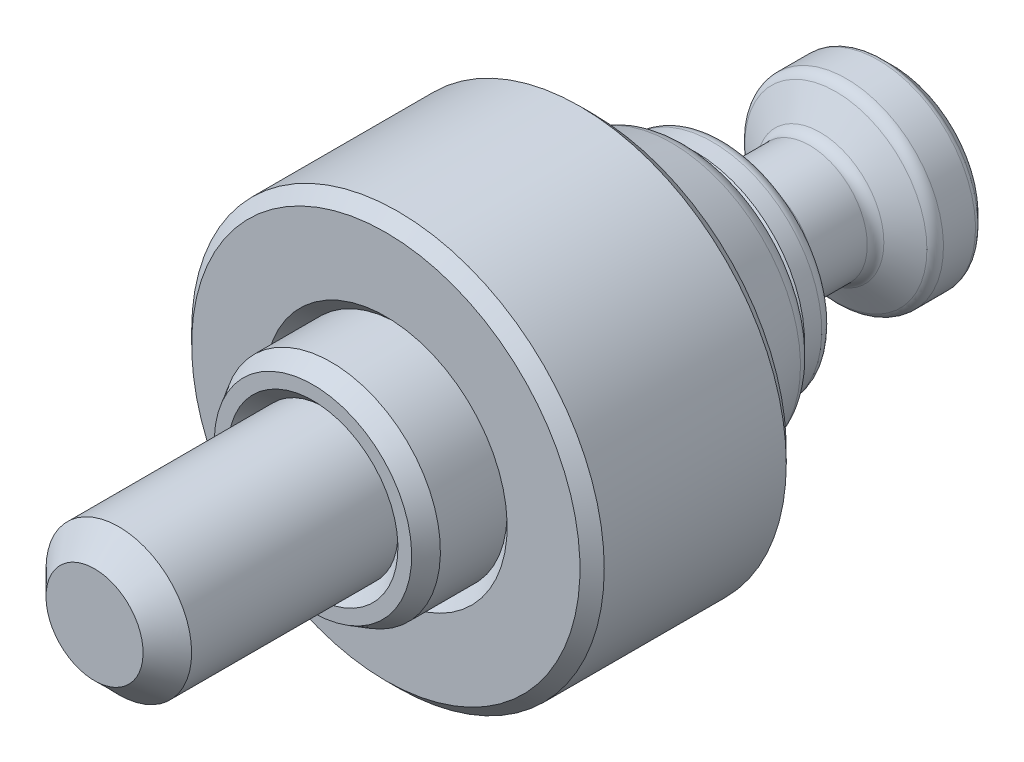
ISO-10303-21;
HEADER;
FILE_DESCRIPTION(('STEP AP214'),'2;1');
FILE_NAME('part.step','',(''),(''),'','','');
FILE_SCHEMA(('AUTOMOTIVE_DESIGN { 1 0 10303 214 1 1 1 1 }'));
ENDSEC;
DATA;
#1=APPLICATION_CONTEXT('core data for automotive mechanical design processes');
#2=APPLICATION_PROTOCOL_DEFINITION('international standard','automotive_design',2000,#1);
#3=PRODUCT_CONTEXT('',#1,'mechanical');
#4=PRODUCT('Part','Part','',(#3));
#5=PRODUCT_RELATED_PRODUCT_CATEGORY('part','',(#4));
#6=PRODUCT_DEFINITION_FORMATION('','',#4);
#7=PRODUCT_DEFINITION_CONTEXT('part definition',#1,'design');
#8=PRODUCT_DEFINITION('design','',#6,#7);
#9=PRODUCT_DEFINITION_SHAPE('','',#8);
#10=(LENGTH_UNIT() NAMED_UNIT(*) SI_UNIT(.MILLI.,.METRE.));
#11=(NAMED_UNIT(*) PLANE_ANGLE_UNIT() SI_UNIT($,.RADIAN.));
#12=(NAMED_UNIT(*) SI_UNIT($,.STERADIAN.) SOLID_ANGLE_UNIT());
#13=UNCERTAINTY_MEASURE_WITH_UNIT(LENGTH_MEASURE(1.E-05),#10,'distance_accuracy_value','');
#14=(GEOMETRIC_REPRESENTATION_CONTEXT(3) GLOBAL_UNCERTAINTY_ASSIGNED_CONTEXT((#13)) GLOBAL_UNIT_ASSIGNED_CONTEXT((#10,
#11,#12)) REPRESENTATION_CONTEXT('',''));
#15=CARTESIAN_POINT('',(0.,0.,0.));
#16=DIRECTION('',(0.,0.,1.));
#17=DIRECTION('',(1.,0.,0.));
#18=AXIS2_PLACEMENT_3D('',#15,#16,#17);
#19=CARTESIAN_POINT('',(0.,0.,0.));
#20=DIRECTION('',(0.,0.,-1.));
#21=DIRECTION('',(0.,1.,0.));
#22=AXIS2_PLACEMENT_3D('',#19,#20,#21);
#23=CYLINDRICAL_SURFACE('',#22,17.);
#24=CARTESIAN_POINT('',(0.,0.,16.));
#25=DIRECTION('',(0.,0.,1.));
#26=DIRECTION('',(0.,-1.,0.));
#27=AXIS2_PLACEMENT_3D('',#24,#25,#26);
#28=CIRCLE('',#27,17.);
#29=CARTESIAN_POINT('',(0.,-17.,16.));
#30=VERTEX_POINT('',#29);
#31=EDGE_CURVE('E331',#30,#30,#28,.F.);
#32=ORIENTED_EDGE('',*,*,#31,.T.);
#33=EDGE_LOOP('',(#32));
#34=FACE_BOUND('',#33,.T.);
#35=CARTESIAN_POINT('',(0.,0.,1.));
#36=DIRECTION('',(0.,0.,-1.));
#37=DIRECTION('',(0.,1.,0.));
#38=AXIS2_PLACEMENT_3D('',#35,#36,#37);
#39=CIRCLE('',#38,17.);
#40=CARTESIAN_POINT('',(0.,17.,1.));
#41=VERTEX_POINT('',#40);
#42=EDGE_CURVE('E180',#41,#41,#39,.F.);
#43=ORIENTED_EDGE('',*,*,#42,.T.);
#44=EDGE_LOOP('',(#43));
#45=FACE_BOUND('',#44,.T.);
#46=ADVANCED_FACE('F14',(#34,#45),#23,.T.);
#47=CARTESIAN_POINT('',(0.,0.,0.));
#48=DIRECTION('',(0.,0.,1.));
#49=DIRECTION('',(0.,-1.,0.));
#50=AXIS2_PLACEMENT_3D('',#47,#48,#49);
#51=CONICAL_SURFACE('',#50,16.,0.78539816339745);
#52=ORIENTED_EDGE('',*,*,#42,.F.);
#53=EDGE_LOOP('',(#52));
#54=FACE_BOUND('',#53,.T.);
#55=CARTESIAN_POINT('',(0.,0.,0.));
#56=DIRECTION('',(0.,0.,-1.));
#57=DIRECTION('',(0.,1.,0.));
#58=AXIS2_PLACEMENT_3D('',#55,#56,#57);
#59=CIRCLE('',#58,16.);
#60=CARTESIAN_POINT('',(0.,16.,0.));
#61=VERTEX_POINT('',#60);
#62=EDGE_CURVE('E340',#61,#61,#59,.T.);
#63=ORIENTED_EDGE('',*,*,#62,.F.);
#64=EDGE_LOOP('',(#63));
#65=FACE_BOUND('',#64,.T.);
#66=ADVANCED_FACE('F308',(#54,#65),#51,.T.);
#67=CARTESIAN_POINT('',(17.,0.,0.));
#68=DIRECTION('',(0.,0.,-1.));
#69=DIRECTION('',(0.,1.,0.));
#70=AXIS2_PLACEMENT_3D('',#67,#68,#69);
#71=PLANE('',#70);
#72=ORIENTED_EDGE('',*,*,#62,.T.);
#73=EDGE_LOOP('',(#72));
#74=FACE_BOUND('',#73,.T.);
#75=CARTESIAN_POINT('',(0.,0.,0.));
#76=DIRECTION('',(0.,0.,-1.));
#77=DIRECTION('',(-1.,0.,0.));
#78=AXIS2_PLACEMENT_3D('',#75,#76,#77);
#79=CIRCLE('',#78,12.05);
#80=CARTESIAN_POINT('',(-12.05,0.,0.));
#81=VERTEX_POINT('',#80);
#82=EDGE_CURVE('E9',#81,#81,#79,.T.);
#83=ORIENTED_EDGE('',*,*,#82,.F.);
#84=EDGE_LOOP('',(#83));
#85=FACE_BOUND('',#84,.T.);
#86=ADVANCED_FACE('F311',(#74,#85),#71,.T.);
#87=CARTESIAN_POINT('',(0.,0.,16.));
#88=DIRECTION('',(0.,0.,-1.));
#89=DIRECTION('',(0.,1.,0.));
#90=AXIS2_PLACEMENT_3D('',#87,#88,#89);
#91=CONICAL_SURFACE('',#90,17.,0.785398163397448);
#92=CARTESIAN_POINT('',(0.,0.,17.));
#93=DIRECTION('',(0.,0.,1.));
#94=DIRECTION('',(0.,-1.,0.));
#95=AXIS2_PLACEMENT_3D('',#92,#93,#94);
#96=CIRCLE('',#95,16.);
#97=CARTESIAN_POINT('',(0.,-16.,17.));
#98=VERTEX_POINT('',#97);
#99=EDGE_CURVE('E335',#98,#98,#96,.T.);
#100=ORIENTED_EDGE('',*,*,#99,.F.);
#101=EDGE_LOOP('',(#100));
#102=FACE_BOUND('',#101,.T.);
#103=ORIENTED_EDGE('',*,*,#31,.F.);
#104=EDGE_LOOP('',(#103));
#105=FACE_BOUND('',#104,.T.);
#106=ADVANCED_FACE('F313',(#102,#105),#91,.T.);
#107=CARTESIAN_POINT('',(9.,0.,17.));
#108=DIRECTION('',(0.,0.,1.));
#109=DIRECTION('',(0.,-1.,0.));
#110=AXIS2_PLACEMENT_3D('',#107,#108,#109);
#111=PLANE('',#110);
#112=CARTESIAN_POINT('',(0.,0.,17.));
#113=DIRECTION('',(0.,0.,1.));
#114=DIRECTION('',(0.,-1.,0.));
#115=AXIS2_PLACEMENT_3D('',#112,#113,#114);
#116=CIRCLE('',#115,10.);
#117=CARTESIAN_POINT('',(0.,-10.,17.));
#118=VERTEX_POINT('',#117);
#119=EDGE_CURVE('E23',#118,#118,#116,.F.);
#120=ORIENTED_EDGE('',*,*,#119,.T.);
#121=EDGE_LOOP('',(#120));
#122=FACE_BOUND('',#121,.T.);
#123=ORIENTED_EDGE('',*,*,#99,.T.);
#124=EDGE_LOOP('',(#123));
#125=FACE_BOUND('',#124,.T.);
#126=ADVANCED_FACE('F306',(#122,#125),#111,.T.);
#127=CARTESIAN_POINT('',(0.,0.,17.));
#128=DIRECTION('',(0.,0.,1.));
#129=DIRECTION('',(0.,-1.,0.));
#130=AXIS2_PLACEMENT_3D('',#127,#128,#129);
#131=CONICAL_SURFACE('',#130,10.,0.785398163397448);
#132=CARTESIAN_POINT('',(0.,0.,16.));
#133=DIRECTION('',(0.,0.,1.));
#134=DIRECTION('',(0.,-1.,0.));
#135=AXIS2_PLACEMENT_3D('',#132,#133,#134);
#136=CIRCLE('',#135,9.);
#137=CARTESIAN_POINT('',(0.,-9.,16.));
#138=VERTEX_POINT('',#137);
#139=EDGE_CURVE('E343',#138,#138,#136,.T.);
#140=ORIENTED_EDGE('',*,*,#139,.F.);
#141=EDGE_LOOP('',(#140));
#142=FACE_BOUND('',#141,.T.);
#143=ORIENTED_EDGE('',*,*,#119,.F.);
#144=EDGE_LOOP('',(#143));
#145=FACE_BOUND('',#144,.T.);
#146=ADVANCED_FACE('F303',(#142,#145),#131,.F.);
#147=CARTESIAN_POINT('',(0.,0.,41.));
#148=DIRECTION('',(0.,0.,1.));
#149=DIRECTION('',(0.,1.,0.));
#150=AXIS2_PLACEMENT_3D('',#147,#148,#149);
#151=PLANE('',#150);
#152=CARTESIAN_POINT('',(0.,0.,41.));
#153=DIRECTION('',(0.,0.,1.));
#154=DIRECTION('',(0.,1.,0.));
#155=AXIS2_PLACEMENT_3D('',#152,#153,#154);
#156=CIRCLE('',#155,4.);
#157=CARTESIAN_POINT('',(0.,4.,41.));
#158=VERTEX_POINT('',#157);
#159=EDGE_CURVE('E128',#158,#158,#156,.T.);
#160=ORIENTED_EDGE('',*,*,#159,.T.);
#161=EDGE_LOOP('',(#160));
#162=FACE_BOUND('',#161,.T.);
#163=ADVANCED_FACE('F291',(#162),#151,.T.);
#164=CARTESIAN_POINT('',(0.,0.,39.));
#165=DIRECTION('',(0.,0.,-1.));
#166=DIRECTION('',(0.,-1.,0.));
#167=AXIS2_PLACEMENT_3D('',#164,#165,#166);
#168=CONICAL_SURFACE('',#167,6.,0.78539816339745);
#169=ORIENTED_EDGE('',*,*,#159,.F.);
#170=EDGE_LOOP('',(#169));
#171=FACE_BOUND('',#170,.T.);
#172=CARTESIAN_POINT('',(0.,0.,39.));
#173=DIRECTION('',(0.,0.,1.));
#174=DIRECTION('',(0.,1.,0.));
#175=AXIS2_PLACEMENT_3D('',#172,#173,#174);
#176=CIRCLE('',#175,6.);
#177=CARTESIAN_POINT('',(0.,6.,39.));
#178=VERTEX_POINT('',#177);
#179=EDGE_CURVE('E125',#178,#178,#176,.F.);
#180=ORIENTED_EDGE('',*,*,#179,.F.);
#181=EDGE_LOOP('',(#180));
#182=FACE_BOUND('',#181,.T.);
#183=ADVANCED_FACE('F272',(#171,#182),#168,.T.);
#184=CARTESIAN_POINT('',(0.,0.,-8.));
#185=DIRECTION('',(0.,0.,-1.));
#186=DIRECTION('',(0.,-1.,0.));
#187=AXIS2_PLACEMENT_3D('',#184,#185,#186);
#188=CYLINDRICAL_SURFACE('',#187,6.);
#189=CARTESIAN_POINT('',(0.,0.,22.));
#190=DIRECTION('',(0.,0.,1.));
#191=DIRECTION('',(0.,-1.,0.));
#192=AXIS2_PLACEMENT_3D('',#189,#190,#191);
#193=CIRCLE('',#192,6.);
#194=CARTESIAN_POINT('',(0.,-6.,22.));
#195=VERTEX_POINT('',#194);
#196=EDGE_CURVE('E171',#195,#195,#193,.T.);
#197=ORIENTED_EDGE('',*,*,#196,.T.);
#198=EDGE_LOOP('',(#197));
#199=FACE_BOUND('',#198,.T.);
#200=ORIENTED_EDGE('',*,*,#179,.T.);
#201=EDGE_LOOP('',(#200));
#202=FACE_BOUND('',#201,.T.);
#203=ADVANCED_FACE('F262',(#199,#202),#188,.T.);
#204=CARTESIAN_POINT('',(0.,0.,23.));
#205=DIRECTION('',(0.,0.,1.));
#206=DIRECTION('',(0.,-1.,0.));
#207=AXIS2_PLACEMENT_3D('',#204,#205,#206);
#208=CONICAL_SURFACE('',#207,7.,0.785398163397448);
#209=ORIENTED_EDGE('',*,*,#196,.F.);
#210=EDGE_LOOP('',(#209));
#211=FACE_BOUND('',#210,.T.);
#212=CARTESIAN_POINT('',(0.,0.,23.));
#213=DIRECTION('',(0.,0.,1.));
#214=DIRECTION('',(0.,-1.,0.));
#215=AXIS2_PLACEMENT_3D('',#212,#213,#214);
#216=CIRCLE('',#215,7.);
#217=CARTESIAN_POINT('',(0.,-7.,23.));
#218=VERTEX_POINT('',#217);
#219=EDGE_CURVE('E168',#218,#218,#216,.F.);
#220=ORIENTED_EDGE('',*,*,#219,.F.);
#221=EDGE_LOOP('',(#220));
#222=FACE_BOUND('',#221,.T.);
#223=ADVANCED_FACE('F259',(#211,#222),#208,.F.);
#224=CARTESIAN_POINT('',(6.,0.,23.));
#225=DIRECTION('',(0.,0.,1.));
#226=DIRECTION('',(0.,-1.,0.));
#227=AXIS2_PLACEMENT_3D('',#224,#225,#226);
#228=PLANE('',#227);
#229=ORIENTED_EDGE('',*,*,#219,.T.);
#230=EDGE_LOOP('',(#229));
#231=FACE_BOUND('',#230,.T.);
#232=CARTESIAN_POINT('',(0.,0.,23.));
#233=DIRECTION('',(0.,0.,1.));
#234=DIRECTION('',(0.,-1.,0.));
#235=AXIS2_PLACEMENT_3D('',#232,#233,#234);
#236=CIRCLE('',#235,8.13397459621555);
#237=CARTESIAN_POINT('',(0.,-8.13397459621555,23.));
#238=VERTEX_POINT('',#237);
#239=EDGE_CURVE('E165',#238,#238,#236,.T.);
#240=ORIENTED_EDGE('',*,*,#239,.T.);
#241=EDGE_LOOP('',(#240));
#242=FACE_BOUND('',#241,.T.);
#243=ADVANCED_FACE('F261',(#231,#242),#228,.T.);
#244=CARTESIAN_POINT('',(0.,0.,21.5));
#245=DIRECTION('',(0.,0.,-1.));
#246=DIRECTION('',(0.,1.,0.));
#247=AXIS2_PLACEMENT_3D('',#244,#245,#246);
#248=CONICAL_SURFACE('',#247,9.,0.523598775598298);
#249=ORIENTED_EDGE('',*,*,#239,.F.);
#250=EDGE_LOOP('',(#249));
#251=FACE_BOUND('',#250,.T.);
#252=CARTESIAN_POINT('',(0.,0.,21.5));
#253=DIRECTION('',(0.,0.,1.));
#254=DIRECTION('',(0.,-1.,0.));
#255=AXIS2_PLACEMENT_3D('',#252,#253,#254);
#256=CIRCLE('',#255,9.);
#257=CARTESIAN_POINT('',(0.,-9.,21.5));
#258=VERTEX_POINT('',#257);
#259=EDGE_CURVE('E162',#258,#258,#256,.F.);
#260=ORIENTED_EDGE('',*,*,#259,.F.);
#261=EDGE_LOOP('',(#260));
#262=FACE_BOUND('',#261,.T.);
#263=ADVANCED_FACE('F269',(#251,#262),#248,.T.);
#264=CARTESIAN_POINT('',(0.,0.,0.));
#265=DIRECTION('',(0.,0.,-1.));
#266=DIRECTION('',(0.,1.,0.));
#267=AXIS2_PLACEMENT_3D('',#264,#265,#266);
#268=CYLINDRICAL_SURFACE('',#267,9.);
#269=ORIENTED_EDGE('',*,*,#259,.T.);
#270=EDGE_LOOP('',(#269));
#271=FACE_BOUND('',#270,.T.);
#272=ORIENTED_EDGE('',*,*,#139,.T.);
#273=EDGE_LOOP('',(#272));
#274=FACE_BOUND('',#273,.T.);
#275=ADVANCED_FACE('F280',(#271,#274),#268,.T.);
#276=CARTESIAN_POINT('',(-2.88675134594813,0.,-21.5));
#277=DIRECTION('',(0.,0.,-1.));
#278=DIRECTION('',(0.,-1.,0.));
#279=AXIS2_PLACEMENT_3D('',#276,#277,#278);
#280=PLANE('',#279);
#281=DIRECTION('',(0.5,-0.86602540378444,0.));
#282=VECTOR('',#281,1.);
#283=CARTESIAN_POINT('',(1.44337567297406,2.5,-21.5));
#284=LINE('',#283,#282);
#285=CARTESIAN_POINT('',(1.44337567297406,2.5,-21.5));
#286=VERTEX_POINT('',#285);
#287=CARTESIAN_POINT('',(2.88675134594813,0.,-21.5));
#288=VERTEX_POINT('',#287);
#289=EDGE_CURVE('E639',#286,#288,#284,.T.);
#290=ORIENTED_EDGE('',*,*,#289,.T.);
#291=DIRECTION('',(-0.5,-0.86602540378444,0.));
#292=VECTOR('',#291,1.);
#293=CARTESIAN_POINT('',(2.88675134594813,0.,-21.5));
#294=LINE('',#293,#292);
#295=CARTESIAN_POINT('',(1.44337567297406,-2.5,-21.5));
#296=VERTEX_POINT('',#295);
#297=EDGE_CURVE('E642',#288,#296,#294,.T.);
#298=ORIENTED_EDGE('',*,*,#297,.T.);
#299=DIRECTION('',(-1.,0.,0.));
#300=VECTOR('',#299,1.);
#301=CARTESIAN_POINT('',(1.44337567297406,-2.5,-21.5));
#302=LINE('',#301,#300);
#303=CARTESIAN_POINT('',(-1.44337567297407,-2.5,-21.5));
#304=VERTEX_POINT('',#303);
#305=EDGE_CURVE('E39',#296,#304,#302,.T.);
#306=ORIENTED_EDGE('',*,*,#305,.T.);
#307=DIRECTION('',(-0.5,0.86602540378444,0.));
#308=VECTOR('',#307,1.);
#309=CARTESIAN_POINT('',(-1.44337567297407,-2.5,-21.5));
#310=LINE('',#309,#308);
#311=CARTESIAN_POINT('',(-2.88675134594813,0.,-21.5));
#312=VERTEX_POINT('',#311);
#313=EDGE_CURVE('E87',#304,#312,#310,.T.);
#314=ORIENTED_EDGE('',*,*,#313,.T.);
#315=DIRECTION('',(0.5,0.86602540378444,0.));
#316=VECTOR('',#315,1.);
#317=CARTESIAN_POINT('',(-2.88675134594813,0.,-21.5));
#318=LINE('',#317,#316);
#319=CARTESIAN_POINT('',(-1.44337567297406,2.5,-21.5));
#320=VERTEX_POINT('',#319);
#321=EDGE_CURVE('E650',#312,#320,#318,.T.);
#322=ORIENTED_EDGE('',*,*,#321,.T.);
#323=DIRECTION('',(1.,0.,0.));
#324=VECTOR('',#323,1.);
#325=CARTESIAN_POINT('',(-1.44337567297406,2.5,-21.5));
#326=LINE('',#325,#324);
#327=EDGE_CURVE('E644',#320,#286,#326,.T.);
#328=ORIENTED_EDGE('',*,*,#327,.T.);
#329=EDGE_LOOP('',(#290,#298,#306,#314,#322,#328));
#330=FACE_BOUND('',#329,.T.);
#331=ADVANCED_FACE('F243',(#330),#280,.T.);
#332=CARTESIAN_POINT('',(-1.44337567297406,2.5,-21.5));
#333=DIRECTION('',(0.,1.,0.));
#334=DIRECTION('',(-1.,0.,0.));
#335=AXIS2_PLACEMENT_3D('',#332,#333,#334);
#336=PLANE('',#335);
#337=CARTESIAN_POINT('',(3.75529073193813,2.5,-25.7571037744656));
#338=CARTESIAN_POINT('',(3.64702350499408,2.5,-25.7050866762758));
#339=CARTESIAN_POINT('',(3.53849413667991,2.5,-25.6536050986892));
#340=CARTESIAN_POINT('',(3.32077111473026,2.5,-25.5520170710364));
#341=CARTESIAN_POINT('',(3.21157734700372,2.5,-25.5019108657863));
#342=CARTESIAN_POINT('',(2.99176231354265,2.5,-25.4030989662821));
#343=CARTESIAN_POINT('',(2.88113640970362,2.5,-25.354403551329));
#344=CARTESIAN_POINT('',(2.65896041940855,2.5,-25.2591768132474));
#345=CARTESIAN_POINT('',(2.54741038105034,2.5,-25.2126453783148));
#346=CARTESIAN_POINT('',(2.32018656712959,2.5,-25.1211049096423));
#347=CARTESIAN_POINT('',(2.20448256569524,2.5,-25.0761704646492));
#348=CARTESIAN_POINT('',(1.97167695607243,2.5,-24.9900069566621));
#349=CARTESIAN_POINT('',(1.85457518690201,2.5,-24.9487783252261));
#350=CARTESIAN_POINT('',(1.61904917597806,2.5,-24.8711984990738));
#351=CARTESIAN_POINT('',(1.50062860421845,2.5,-24.8348362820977));
#352=CARTESIAN_POINT('',(1.26209548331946,2.5,-24.7682348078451));
#353=CARTESIAN_POINT('',(1.14198351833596,2.5,-24.7379934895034));
#354=CARTESIAN_POINT('',(0.900603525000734,2.5,-24.6853063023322));
#355=CARTESIAN_POINT('',(0.779343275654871,2.5,-24.6628254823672));
#356=CARTESIAN_POINT('',(0.535452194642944,2.5,-24.6270217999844));
#357=CARTESIAN_POINT('',(0.412821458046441,2.5,-24.613698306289));
#358=CARTESIAN_POINT('',(0.168346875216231,2.5,-24.5974461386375));
#359=CARTESIAN_POINT('',(0.0465114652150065,2.5,-24.5943936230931));
#360=CARTESIAN_POINT('',(-0.196987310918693,2.5,-24.5986229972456));
#361=CARTESIAN_POINT('',(-0.318650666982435,2.5,-24.6059054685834));
#362=CARTESIAN_POINT('',(-0.528961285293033,2.5,-24.6269346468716));
#363=CARTESIAN_POINT('',(-0.617841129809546,2.5,-24.6384658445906));
#364=CARTESIAN_POINT('',(-0.79486562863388,2.5,-24.6662557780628));
#365=CARTESIAN_POINT('',(-0.883010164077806,2.5,-24.6825152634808));
#366=CARTESIAN_POINT('',(-1.14625702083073,2.5,-24.7375247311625));
#367=CARTESIAN_POINT('',(-1.32006063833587,2.5,-24.7824931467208));
#368=CARTESIAN_POINT('',(-1.66786365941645,2.5,-24.8853843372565));
#369=CARTESIAN_POINT('',(-1.84178128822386,2.5,-24.9435732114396));
#370=CARTESIAN_POINT('',(-2.10027535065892,2.5,-25.0372164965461));
#371=CARTESIAN_POINT('',(-2.18603097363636,2.5,-25.0694858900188));
#372=CARTESIAN_POINT('',(-2.35685065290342,2.5,-25.1358045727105));
#373=CARTESIAN_POINT('',(-2.44191471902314,2.5,-25.1698538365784));
#374=CARTESIAN_POINT('',(-2.65170124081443,2.5,-25.2559503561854));
#375=CARTESIAN_POINT('',(-2.77606735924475,2.5,-25.3088637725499));
#376=CARTESIAN_POINT('',(-3.02372119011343,2.5,-25.4171632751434));
#377=CARTESIAN_POINT('',(-3.14700883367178,2.5,-25.4725495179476));
#378=CARTESIAN_POINT('',(-3.51560806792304,2.5,-25.6415916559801));
#379=CARTESIAN_POINT('',(-3.75960486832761,2.5,-25.7581094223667));
#380=CARTESIAN_POINT('',(-4.24550152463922,2.5,-25.9960606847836));
#381=CARTESIAN_POINT('',(-4.48739872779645,2.5,-26.1174995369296));
#382=CARTESIAN_POINT('',(-4.9695180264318,2.5,-26.3635760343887));
#383=CARTESIAN_POINT('',(-5.20974033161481,2.5,-26.4882132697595));
#384=CARTESIAN_POINT('',(-5.66762978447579,2.5,-26.7285005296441));
#385=CARTESIAN_POINT('',(-5.88539712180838,2.5,-26.8439602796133));
#386=CARTESIAN_POINT('',(-6.32020373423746,2.5,-27.0762610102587));
#387=CARTESIAN_POINT('',(-6.53724298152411,2.5,-27.1931020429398));
#388=CARTESIAN_POINT('',(-6.97023299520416,2.5,-27.4275423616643));
#389=CARTESIAN_POINT('',(-7.18618512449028,2.5,-27.5451391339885));
#390=CARTESIAN_POINT('',(-7.61763021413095,2.5,-27.781144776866));
#391=CARTESIAN_POINT('',(-7.83312319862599,2.5,-27.8995536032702));
#392=CARTESIAN_POINT('',(-8.04844972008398,2.5,-28.0182624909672));
#393=B_SPLINE_CURVE_WITH_KNOTS('',3,(#337,#338,#339,#340,#341,#342,#343,#344,#345,#346,#347,
#348,#349,#350,#351,#352,#353,#354,#355,#356,#357,#358,#359,#360,#361,#362,#363,#364,#365,#366,
#367,#368,#369,#370,#371,#372,#373,#374,#375,#376,#377,#378,#379,#380,#381,#382,#383,#384,#385,
#386,#387,#388,#389,#390,#391,#392),.UNSPECIFIED.,.F.,.F.,(4,2,2,2,2,2,2,2,2,2,2,2,2,2,2,2,2,2,
2,2,2,2,2,2,2,2,2,4),(0.,0.360349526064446,0.720762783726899,1.08335154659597,1.44592155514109,
1.81824159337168,2.19060493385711,2.56211007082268,2.9334899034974,3.30317462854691,
3.67283386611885,4.03801967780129,4.40322604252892,4.67196862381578,4.94075383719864,
5.47866070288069,6.02854222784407,6.30340498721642,6.57826383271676,6.98369059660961,
7.38914306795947,8.20021426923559,9.01219328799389,9.82406874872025,10.5635102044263,
11.3029795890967,12.0406625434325,12.7783057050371),.UNSPECIFIED.);
#394=CARTESIAN_POINT('',(1.44337567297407,2.5,-24.8191458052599));
#395=VERTEX_POINT('',#394);
#396=CARTESIAN_POINT('',(-1.44337567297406,2.5,-24.8191458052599));
#397=VERTEX_POINT('',#396);
#398=EDGE_CURVE('E228',#395,#397,#393,.T.);
#399=ORIENTED_EDGE('',*,*,#398,.F.);
#400=DIRECTION('',(0.,0.,-1.));
#401=VECTOR('',#400,1.);
#402=CARTESIAN_POINT('',(1.44337567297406,2.5,-21.5));
#403=LINE('',#402,#401);
#404=EDGE_CURVE('E100',#286,#395,#403,.T.);
#405=ORIENTED_EDGE('',*,*,#404,.F.);
#406=ORIENTED_EDGE('',*,*,#327,.F.);
#407=DIRECTION('',(0.,0.,-1.));
#408=VECTOR('',#407,1.);
#409=CARTESIAN_POINT('',(-1.44337567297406,2.5,-21.5));
#410=LINE('',#409,#408);
#411=EDGE_CURVE('E103',#320,#397,#410,.T.);
#412=ORIENTED_EDGE('',*,*,#411,.T.);
#413=EDGE_LOOP('',(#399,#405,#406,#412));
#414=FACE_BOUND('',#413,.T.);
#415=ADVANCED_FACE('F239',(#414),#336,.F.);
#416=CARTESIAN_POINT('',(1.44337567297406,2.5,-21.5));
#417=DIRECTION('',(0.86602540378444,0.5,0.));
#418=DIRECTION('',(-0.5,0.86602540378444,0.));
#419=AXIS2_PLACEMENT_3D('',#416,#417,#418);
#420=PLANE('',#419);
#421=CARTESIAN_POINT('',(2.88686681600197,-0.000199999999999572,-24.8192124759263));
#422=CARTESIAN_POINT('',(2.82343724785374,0.109663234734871,-24.7825764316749));
#423=CARTESIAN_POINT('',(2.75946016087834,0.220474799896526,-24.7492570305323));
#424=CARTESIAN_POINT('',(2.63039810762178,0.44401683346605,-24.6910970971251));
#425=CARTESIAN_POINT('',(2.5653108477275,0.556751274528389,-24.666277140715));
#426=CARTESIAN_POINT('',(2.43594298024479,0.780822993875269,-24.6276404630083));
#427=CARTESIAN_POINT('',(2.37168227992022,0.892125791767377,-24.6135666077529));
#428=CARTESIAN_POINT('',(2.24285844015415,1.11525522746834,-24.59676396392));
#429=CARTESIAN_POINT('',(2.17829576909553,1.22708105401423,-24.5940212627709));
#430=CARTESIAN_POINT('',(2.05765212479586,1.43604197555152,-24.5997205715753));
#431=CARTESIAN_POINT('',(2.0015531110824,1.53320831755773,-24.6067632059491));
#432=CARTESIAN_POINT('',(1.88972057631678,1.726907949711,-24.6290862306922));
#433=CARTESIAN_POINT('',(1.8339874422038,1.82344056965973,-24.6443742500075));
#434=CARTESIAN_POINT('',(1.7219242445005,2.01753972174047,-24.6825939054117));
#435=CARTESIAN_POINT('',(1.66560836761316,2.11508168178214,-24.7056875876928));
#436=CARTESIAN_POINT('',(1.55381665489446,2.30871060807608,-24.7581014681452));
#437=CARTESIAN_POINT('',(1.49833938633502,2.40480005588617,-24.7874093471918));
#438=CARTESIAN_POINT('',(1.44326020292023,2.5002,-24.8192124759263));
#439=B_SPLINE_CURVE_WITH_KNOTS('',3,(#421,#422,#423,#424,#425,#426,#427,#428,#429,#430,#431,
#432,#433,#434,#435,#436,#437,#438),.UNSPECIFIED.,.F.,.F.,(4,2,2,2,2,2,2,2,4),(0.,
0.396285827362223,0.793524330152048,1.18093086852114,1.56786160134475,1.90479741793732,
2.24204551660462,2.58677531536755,2.93082800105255),.UNSPECIFIED.);
#440=CARTESIAN_POINT('',(2.88675134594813,0.,-24.8191458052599));
#441=VERTEX_POINT('',#440);
#442=EDGE_CURVE('E221',#441,#395,#439,.T.);
#443=ORIENTED_EDGE('',*,*,#442,.F.);
#444=DIRECTION('',(0.,0.,-1.));
#445=VECTOR('',#444,1.);
#446=CARTESIAN_POINT('',(2.88675134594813,0.,-21.5));
#447=LINE('',#446,#445);
#448=EDGE_CURVE('E93',#288,#441,#447,.T.);
#449=ORIENTED_EDGE('',*,*,#448,.F.);
#450=ORIENTED_EDGE('',*,*,#289,.F.);
#451=ORIENTED_EDGE('',*,*,#404,.T.);
#452=EDGE_LOOP('',(#443,#449,#450,#451));
#453=FACE_BOUND('',#452,.T.);
#454=ADVANCED_FACE('F242',(#453),#420,.F.);
#455=CARTESIAN_POINT('',(2.88675134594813,0.,-21.5));
#456=DIRECTION('',(0.86602540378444,-0.5,0.));
#457=DIRECTION('',(0.5,0.86602540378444,0.));
#458=AXIS2_PLACEMENT_3D('',#455,#456,#457);
#459=PLANE('',#458);
#460=CARTESIAN_POINT('',(1.44326020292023,-2.5002,-24.8192124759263));
#461=CARTESIAN_POINT('',(1.50668977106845,-2.39033676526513,-24.7825764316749));
#462=CARTESIAN_POINT('',(1.57066685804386,-2.27952520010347,-24.7492570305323));
#463=CARTESIAN_POINT('',(1.69972891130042,-2.05598316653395,-24.6910970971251));
#464=CARTESIAN_POINT('',(1.7648161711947,-1.94324872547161,-24.666277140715));
#465=CARTESIAN_POINT('',(1.8941840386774,-1.71917700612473,-24.6276404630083));
#466=CARTESIAN_POINT('',(1.95844473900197,-1.60787420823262,-24.6135666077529));
#467=CARTESIAN_POINT('',(2.08726857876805,-1.38474477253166,-24.59676396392));
#468=CARTESIAN_POINT('',(2.15183124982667,-1.27291894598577,-24.5940212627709));
#469=CARTESIAN_POINT('',(2.27247489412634,-1.06395802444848,-24.5997205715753));
#470=CARTESIAN_POINT('',(2.32857390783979,-0.96679168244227,-24.6067632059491));
#471=CARTESIAN_POINT('',(2.44040644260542,-0.773092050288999,-24.6290862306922));
#472=CARTESIAN_POINT('',(2.4961395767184,-0.676559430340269,-24.6443742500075));
#473=CARTESIAN_POINT('',(2.60820277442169,-0.482460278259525,-24.6825939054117));
#474=CARTESIAN_POINT('',(2.66451865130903,-0.384918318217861,-24.7056875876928));
#475=CARTESIAN_POINT('',(2.77631036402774,-0.191289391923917,-24.7581014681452));
#476=CARTESIAN_POINT('',(2.83178763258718,-0.0951999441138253,-24.7874093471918));
#477=CARTESIAN_POINT('',(2.88686681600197,0.000200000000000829,-24.8192124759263));
#478=B_SPLINE_CURVE_WITH_KNOTS('',3,(#460,#461,#462,#463,#464,#465,#466,#467,#468,#469,#470,
#471,#472,#473,#474,#475,#476,#477),.UNSPECIFIED.,.F.,.F.,(4,2,2,2,2,2,2,2,4),(0.,
0.396285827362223,0.793524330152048,1.18093086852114,1.56786160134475,1.90479741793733,
2.24204551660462,2.58677531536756,2.93082800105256),.UNSPECIFIED.);
#479=CARTESIAN_POINT('',(1.44337567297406,-2.5,-24.8191458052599));
#480=VERTEX_POINT('',#479);
#481=EDGE_CURVE('E84',#480,#441,#478,.T.);
#482=ORIENTED_EDGE('',*,*,#481,.F.);
#483=DIRECTION('',(0.,0.,-1.));
#484=VECTOR('',#483,1.);
#485=CARTESIAN_POINT('',(1.44337567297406,-2.5,-21.5));
#486=LINE('',#485,#484);
#487=EDGE_CURVE('E83',#296,#480,#486,.T.);
#488=ORIENTED_EDGE('',*,*,#487,.F.);
#489=ORIENTED_EDGE('',*,*,#297,.F.);
#490=ORIENTED_EDGE('',*,*,#448,.T.);
#491=EDGE_LOOP('',(#482,#488,#489,#490));
#492=FACE_BOUND('',#491,.T.);
#493=ADVANCED_FACE('F537',(#492),#459,.F.);
#494=CARTESIAN_POINT('',(1.44337567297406,-2.5,-21.5));
#495=DIRECTION('',(0.,-1.,0.));
#496=DIRECTION('',(1.,0.,0.));
#497=AXIS2_PLACEMENT_3D('',#494,#495,#496);
#498=PLANE('',#497);
#499=CARTESIAN_POINT('',(3.75529073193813,-2.5,-25.7571037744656));
#500=CARTESIAN_POINT('',(3.64702350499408,-2.5,-25.7050866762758));
#501=CARTESIAN_POINT('',(3.53849413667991,-2.5,-25.6536050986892));
#502=CARTESIAN_POINT('',(3.32077111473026,-2.5,-25.5520170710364));
#503=CARTESIAN_POINT('',(3.21157734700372,-2.5,-25.5019108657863));
#504=CARTESIAN_POINT('',(2.99176231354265,-2.5,-25.4030989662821));
#505=CARTESIAN_POINT('',(2.88113640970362,-2.5,-25.354403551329));
#506=CARTESIAN_POINT('',(2.65896041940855,-2.5,-25.2591768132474));
#507=CARTESIAN_POINT('',(2.54741038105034,-2.5,-25.2126453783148));
#508=CARTESIAN_POINT('',(2.32018656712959,-2.5,-25.1211049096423));
#509=CARTESIAN_POINT('',(2.20448256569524,-2.5,-25.0761704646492));
#510=CARTESIAN_POINT('',(1.97167695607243,-2.5,-24.9900069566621));
#511=CARTESIAN_POINT('',(1.85457518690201,-2.5,-24.9487783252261));
#512=CARTESIAN_POINT('',(1.61904917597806,-2.5,-24.8711984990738));
#513=CARTESIAN_POINT('',(1.50062860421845,-2.5,-24.8348362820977));
#514=CARTESIAN_POINT('',(1.26209548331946,-2.5,-24.7682348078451));
#515=CARTESIAN_POINT('',(1.14198351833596,-2.5,-24.7379934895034));
#516=CARTESIAN_POINT('',(0.900603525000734,-2.5,-24.6853063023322));
#517=CARTESIAN_POINT('',(0.779343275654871,-2.5,-24.6628254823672));
#518=CARTESIAN_POINT('',(0.535452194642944,-2.5,-24.6270217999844));
#519=CARTESIAN_POINT('',(0.412821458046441,-2.5,-24.613698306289));
#520=CARTESIAN_POINT('',(0.168346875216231,-2.5,-24.5974461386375));
#521=CARTESIAN_POINT('',(0.0465114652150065,-2.5,-24.5943936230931));
#522=CARTESIAN_POINT('',(-0.196987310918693,-2.5,-24.5986229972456));
#523=CARTESIAN_POINT('',(-0.318650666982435,-2.5,-24.6059054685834));
#524=CARTESIAN_POINT('',(-0.528961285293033,-2.5,-24.6269346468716));
#525=CARTESIAN_POINT('',(-0.617841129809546,-2.5,-24.6384658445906));
#526=CARTESIAN_POINT('',(-0.79486562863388,-2.5,-24.6662557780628));
#527=CARTESIAN_POINT('',(-0.883010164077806,-2.5,-24.6825152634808));
#528=CARTESIAN_POINT('',(-1.14625702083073,-2.5,-24.7375247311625));
#529=CARTESIAN_POINT('',(-1.32006063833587,-2.5,-24.7824931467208));
#530=CARTESIAN_POINT('',(-1.66786365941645,-2.5,-24.8853843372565));
#531=CARTESIAN_POINT('',(-1.84178128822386,-2.5,-24.9435732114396));
#532=CARTESIAN_POINT('',(-2.10027535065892,-2.5,-25.0372164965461));
#533=CARTESIAN_POINT('',(-2.18603097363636,-2.5,-25.0694858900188));
#534=CARTESIAN_POINT('',(-2.35685065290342,-2.5,-25.1358045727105));
#535=CARTESIAN_POINT('',(-2.44191471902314,-2.5,-25.1698538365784));
#536=CARTESIAN_POINT('',(-2.65170124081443,-2.5,-25.2559503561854));
#537=CARTESIAN_POINT('',(-2.77606735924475,-2.5,-25.3088637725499));
#538=CARTESIAN_POINT('',(-3.02372119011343,-2.5,-25.4171632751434));
#539=CARTESIAN_POINT('',(-3.14700883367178,-2.5,-25.4725495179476));
#540=CARTESIAN_POINT('',(-3.51560806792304,-2.5,-25.6415916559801));
#541=CARTESIAN_POINT('',(-3.75960486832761,-2.5,-25.7581094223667));
#542=CARTESIAN_POINT('',(-4.24550152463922,-2.5,-25.9960606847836));
#543=CARTESIAN_POINT('',(-4.48739872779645,-2.5,-26.1174995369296));
#544=CARTESIAN_POINT('',(-4.9695180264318,-2.5,-26.3635760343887));
#545=CARTESIAN_POINT('',(-5.20974033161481,-2.5,-26.4882132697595));
#546=CARTESIAN_POINT('',(-5.66762978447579,-2.5,-26.7285005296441));
#547=CARTESIAN_POINT('',(-5.88539712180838,-2.5,-26.8439602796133));
#548=CARTESIAN_POINT('',(-6.32020373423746,-2.5,-27.0762610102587));
#549=CARTESIAN_POINT('',(-6.53724298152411,-2.5,-27.1931020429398));
#550=CARTESIAN_POINT('',(-6.97023299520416,-2.5,-27.4275423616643));
#551=CARTESIAN_POINT('',(-7.18618512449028,-2.5,-27.5451391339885));
#552=CARTESIAN_POINT('',(-7.61763021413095,-2.5,-27.781144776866));
#553=CARTESIAN_POINT('',(-7.83312319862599,-2.5,-27.8995536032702));
#554=CARTESIAN_POINT('',(-8.04844972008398,-2.5,-28.0182624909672));
#555=B_SPLINE_CURVE_WITH_KNOTS('',3,(#499,#500,#501,#502,#503,#504,#505,#506,#507,#508,#509,
#510,#511,#512,#513,#514,#515,#516,#517,#518,#519,#520,#521,#522,#523,#524,#525,#526,#527,#528,
#529,#530,#531,#532,#533,#534,#535,#536,#537,#538,#539,#540,#541,#542,#543,#544,#545,#546,#547,
#548,#549,#550,#551,#552,#553,#554),.UNSPECIFIED.,.F.,.F.,(4,2,2,2,2,2,2,2,2,2,2,2,2,2,2,2,2,2,
2,2,2,2,2,2,2,2,2,4),(0.,0.360349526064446,0.720762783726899,1.08335154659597,1.44592155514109,
1.81824159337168,2.19060493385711,2.56211007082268,2.9334899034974,3.30317462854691,
3.67283386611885,4.03801967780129,4.40322604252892,4.67196862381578,4.94075383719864,
5.47866070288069,6.02854222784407,6.30340498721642,6.57826383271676,6.98369059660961,
7.38914306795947,8.20021426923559,9.01219328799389,9.82406874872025,10.5635102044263,
11.3029795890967,12.0406625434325,12.7783057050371),.UNSPECIFIED.);
#556=CARTESIAN_POINT('',(-1.44337567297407,-2.5,-24.8191458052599));
#557=VERTEX_POINT('',#556);
#558=EDGE_CURVE('E69',#557,#480,#555,.F.);
#559=ORIENTED_EDGE('',*,*,#558,.F.);
#560=DIRECTION('',(0.,0.,-1.));
#561=VECTOR('',#560,1.);
#562=CARTESIAN_POINT('',(-1.44337567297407,-2.5,-21.5));
#563=LINE('',#562,#561);
#564=EDGE_CURVE('E80',#304,#557,#563,.T.);
#565=ORIENTED_EDGE('',*,*,#564,.F.);
#566=ORIENTED_EDGE('',*,*,#305,.F.);
#567=ORIENTED_EDGE('',*,*,#487,.T.);
#568=EDGE_LOOP('',(#559,#565,#566,#567));
#569=FACE_BOUND('',#568,.T.);
#570=ADVANCED_FACE('F79',(#569),#498,.F.);
#571=CARTESIAN_POINT('',(-1.44337567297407,-2.5,-21.5));
#572=DIRECTION('',(-0.86602540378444,-0.5,0.));
#573=DIRECTION('',(0.5,-0.86602540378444,0.));
#574=AXIS2_PLACEMENT_3D('',#571,#572,#573);
#575=PLANE('',#574);
#576=CARTESIAN_POINT('',(-2.88686681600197,0.000200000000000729,-24.8192124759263));
#577=CARTESIAN_POINT('',(-2.82343724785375,-0.109663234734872,-24.7825764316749));
#578=CARTESIAN_POINT('',(-2.75946016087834,-0.220474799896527,-24.7492570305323));
#579=CARTESIAN_POINT('',(-2.63039810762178,-0.444016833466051,-24.6910970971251));
#580=CARTESIAN_POINT('',(-2.5653108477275,-0.55675127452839,-24.666277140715));
#581=CARTESIAN_POINT('',(-2.43594298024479,-0.78082299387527,-24.6276404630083));
#582=CARTESIAN_POINT('',(-2.37168227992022,-0.892125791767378,-24.6135666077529));
#583=CARTESIAN_POINT('',(-2.24285844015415,-1.11525522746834,-24.59676396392));
#584=CARTESIAN_POINT('',(-2.17829576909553,-1.22708105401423,-24.5940212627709));
#585=CARTESIAN_POINT('',(-2.05765212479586,-1.43604197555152,-24.5997205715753));
#586=CARTESIAN_POINT('',(-2.0015531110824,-1.53320831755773,-24.6067632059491));
#587=CARTESIAN_POINT('',(-1.88972057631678,-1.726907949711,-24.6290862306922));
#588=CARTESIAN_POINT('',(-1.8339874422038,-1.82344056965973,-24.6443742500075));
#589=CARTESIAN_POINT('',(-1.72192424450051,-2.01753972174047,-24.6825939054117));
#590=CARTESIAN_POINT('',(-1.66560836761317,-2.11508168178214,-24.7056875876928));
#591=CARTESIAN_POINT('',(-1.55381665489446,-2.30871060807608,-24.7581014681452));
#592=CARTESIAN_POINT('',(-1.49833938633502,-2.40480005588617,-24.7874093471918));
#593=CARTESIAN_POINT('',(-1.44326020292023,-2.5002,-24.8192124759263));
#594=B_SPLINE_CURVE_WITH_KNOTS('',3,(#576,#577,#578,#579,#580,#581,#582,#583,#584,#585,#586,
#587,#588,#589,#590,#591,#592,#593),.UNSPECIFIED.,.F.,.F.,(4,2,2,2,2,2,2,2,4),(0.,
0.396285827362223,0.793524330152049,1.18093086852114,1.56786160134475,1.90479741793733,
2.24204551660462,2.58677531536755,2.93082800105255),.UNSPECIFIED.);
#595=CARTESIAN_POINT('',(-2.88675134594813,0.,-24.8191458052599));
#596=VERTEX_POINT('',#595);
#597=EDGE_CURVE('E66',#596,#557,#594,.T.);
#598=ORIENTED_EDGE('',*,*,#597,.F.);
#599=DIRECTION('',(0.,0.,-1.));
#600=VECTOR('',#599,1.);
#601=CARTESIAN_POINT('',(-2.88675134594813,0.,-21.5));
#602=LINE('',#601,#600);
#603=EDGE_CURVE('E106',#312,#596,#602,.T.);
#604=ORIENTED_EDGE('',*,*,#603,.F.);
#605=ORIENTED_EDGE('',*,*,#313,.F.);
#606=ORIENTED_EDGE('',*,*,#564,.T.);
#607=EDGE_LOOP('',(#598,#604,#605,#606));
#608=FACE_BOUND('',#607,.T.);
#609=ADVANCED_FACE('F86',(#608),#575,.F.);
#610=CARTESIAN_POINT('',(-2.88675134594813,0.,-21.5));
#611=DIRECTION('',(-0.86602540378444,0.5,0.));
#612=DIRECTION('',(-0.5,-0.86602540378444,0.));
#613=AXIS2_PLACEMENT_3D('',#610,#611,#612);
#614=PLANE('',#613);
#615=CARTESIAN_POINT('',(-1.44326020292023,2.5002,-24.8192124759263));
#616=CARTESIAN_POINT('',(-1.50668977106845,2.39033676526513,-24.7825764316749));
#617=CARTESIAN_POINT('',(-1.57066685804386,2.27952520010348,-24.7492570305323));
#618=CARTESIAN_POINT('',(-1.69972891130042,2.05598316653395,-24.6910970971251));
#619=CARTESIAN_POINT('',(-1.7648161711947,1.94324872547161,-24.666277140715));
#620=CARTESIAN_POINT('',(-1.89418403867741,1.71917700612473,-24.6276404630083));
#621=CARTESIAN_POINT('',(-1.95844473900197,1.60787420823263,-24.6135666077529));
#622=CARTESIAN_POINT('',(-2.08726857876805,1.38474477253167,-24.59676396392));
#623=CARTESIAN_POINT('',(-2.15183124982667,1.27291894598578,-24.5940212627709));
#624=CARTESIAN_POINT('',(-2.27247489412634,1.06395802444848,-24.5997205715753));
#625=CARTESIAN_POINT('',(-2.3285739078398,0.966791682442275,-24.6067632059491));
#626=CARTESIAN_POINT('',(-2.44040644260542,0.773092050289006,-24.6290862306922));
#627=CARTESIAN_POINT('',(-2.4961395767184,0.676559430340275,-24.6443742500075));
#628=CARTESIAN_POINT('',(-2.60820277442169,0.482460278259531,-24.6825939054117));
#629=CARTESIAN_POINT('',(-2.66451865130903,0.384918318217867,-24.7056875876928));
#630=CARTESIAN_POINT('',(-2.77631036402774,0.191289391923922,-24.7581014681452));
#631=CARTESIAN_POINT('',(-2.83178763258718,0.0951999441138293,-24.7874093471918));
#632=CARTESIAN_POINT('',(-2.88686681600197,-0.000199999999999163,-24.8192124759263));
#633=B_SPLINE_CURVE_WITH_KNOTS('',3,(#615,#616,#617,#618,#619,#620,#621,#622,#623,#624,#625,
#626,#627,#628,#629,#630,#631,#632),.UNSPECIFIED.,.F.,.F.,(4,2,2,2,2,2,2,2,4),(0.,
0.39628582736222,0.793524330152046,1.18093086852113,1.56786160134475,1.90479741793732,
2.24204551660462,2.58677531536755,2.93082800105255),.UNSPECIFIED.);
#634=EDGE_CURVE('E31',#397,#596,#633,.T.);
#635=ORIENTED_EDGE('',*,*,#634,.F.);
#636=ORIENTED_EDGE('',*,*,#411,.F.);
#637=ORIENTED_EDGE('',*,*,#321,.F.);
#638=ORIENTED_EDGE('',*,*,#603,.T.);
#639=EDGE_LOOP('',(#635,#636,#637,#638));
#640=FACE_BOUND('',#639,.T.);
#641=ADVANCED_FACE('F202',(#640),#614,.F.);
#642=CARTESIAN_POINT('',(0.,0.,-25.));
#643=DIRECTION('',(0.,0.,-1.));
#644=DIRECTION('',(0.,-1.,0.));
#645=AXIS2_PLACEMENT_3D('',#642,#643,#644);
#646=CONICAL_SURFACE('',#645,3.2,1.0471975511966);
#647=CARTESIAN_POINT('',(0.,0.,-25.));
#648=DIRECTION('',(0.,0.,1.));
#649=DIRECTION('',(0.,1.,0.));
#650=AXIS2_PLACEMENT_3D('',#647,#648,#649);
#651=CIRCLE('',#650,3.2);
#652=CARTESIAN_POINT('',(0.,3.2,-25.));
#653=VERTEX_POINT('',#652);
#654=EDGE_CURVE('E75',#653,#653,#651,.T.);
#655=ORIENTED_EDGE('',*,*,#654,.F.);
#656=EDGE_LOOP('',(#655));
#657=FACE_BOUND('',#656,.T.);
#658=ORIENTED_EDGE('',*,*,#634,.T.);
#659=ORIENTED_EDGE('',*,*,#597,.T.);
#660=ORIENTED_EDGE('',*,*,#558,.T.);
#661=ORIENTED_EDGE('',*,*,#481,.T.);
#662=ORIENTED_EDGE('',*,*,#442,.T.);
#663=ORIENTED_EDGE('',*,*,#398,.T.);
#664=EDGE_LOOP('',(#658,#659,#660,#661,#662,#663));
#665=FACE_BOUND('',#664,.T.);
#666=ADVANCED_FACE('F68',(#657,#665),#646,.F.);
#667=CARTESIAN_POINT('',(-9.,0.,-25.));
#668=DIRECTION('',(0.,0.,-1.));
#669=DIRECTION('',(0.,-1.,0.));
#670=AXIS2_PLACEMENT_3D('',#667,#668,#669);
#671=PLANE('',#670);
#672=CARTESIAN_POINT('',(0.,0.,-25.));
#673=DIRECTION('',(0.,0.,-1.));
#674=DIRECTION('',(0.,-1.,0.));
#675=AXIS2_PLACEMENT_3D('',#672,#673,#674);
#676=CIRCLE('',#675,6.38578643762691);
#677=CARTESIAN_POINT('',(0.,-6.38578643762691,-25.));
#678=VERTEX_POINT('',#677);
#679=EDGE_CURVE('E134',#678,#678,#676,.T.);
#680=ORIENTED_EDGE('',*,*,#679,.T.);
#681=EDGE_LOOP('',(#680));
#682=FACE_BOUND('',#681,.T.);
#683=ORIENTED_EDGE('',*,*,#654,.T.);
#684=EDGE_LOOP('',(#683));
#685=FACE_BOUND('',#684,.T.);
#686=ADVANCED_FACE('F201',(#682,#685),#671,.T.);
#687=CARTESIAN_POINT('',(0.,0.,-24.));
#688=DIRECTION('',(0.,0.,-1.));
#689=DIRECTION('',(0.,-1.,0.));
#690=AXIS2_PLACEMENT_3D('',#687,#688,#689);
#691=TOROIDAL_SURFACE('',#690,6.38578643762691,1.);
#692=ORIENTED_EDGE('',*,*,#679,.F.);
#693=EDGE_LOOP('',(#692));
#694=FACE_BOUND('',#693,.T.);
#695=CARTESIAN_POINT('',(0.,0.,-24.7071067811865));
#696=DIRECTION('',(0.,0.,-1.));
#697=DIRECTION('',(0.,-1.,0.));
#698=AXIS2_PLACEMENT_3D('',#695,#696,#697);
#699=CIRCLE('',#698,7.09289321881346);
#700=CARTESIAN_POINT('',(0.,-7.09289321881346,-24.7071067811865));
#701=VERTEX_POINT('',#700);
#702=EDGE_CURVE('E131',#701,#701,#699,.F.);
#703=ORIENTED_EDGE('',*,*,#702,.F.);
#704=EDGE_LOOP('',(#703));
#705=FACE_BOUND('',#704,.T.);
#706=ADVANCED_FACE('F204',(#694,#705),#691,.T.);
#707=CARTESIAN_POINT('',(0.,0.,-23.8));
#708=DIRECTION('',(0.,0.,1.));
#709=DIRECTION('',(0.,1.,0.));
#710=AXIS2_PLACEMENT_3D('',#707,#708,#709);
#711=CONICAL_SURFACE('',#710,8.,0.785398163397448);
#712=ORIENTED_EDGE('',*,*,#702,.T.);
#713=EDGE_LOOP('',(#712));
#714=FACE_BOUND('',#713,.T.);
#715=CARTESIAN_POINT('',(0.,0.,-23.9464466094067));
#716=DIRECTION('',(0.,0.,-1.));
#717=DIRECTION('',(0.,-1.,0.));
#718=AXIS2_PLACEMENT_3D('',#715,#716,#717);
#719=CIRCLE('',#718,7.85355339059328);
#720=CARTESIAN_POINT('',(0.,-7.85355339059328,-23.9464466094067));
#721=VERTEX_POINT('',#720);
#722=EDGE_CURVE('E122',#721,#721,#719,.T.);
#723=ORIENTED_EDGE('',*,*,#722,.T.);
#724=EDGE_LOOP('',(#723));
#725=FACE_BOUND('',#724,.T.);
#726=ADVANCED_FACE('F207',(#714,#725),#711,.T.);
#727=CARTESIAN_POINT('',(0.,0.,-23.5928932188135));
#728=DIRECTION('',(0.,0.,-1.));
#729=DIRECTION('',(0.,-1.,0.));
#730=AXIS2_PLACEMENT_3D('',#727,#728,#729);
#731=TOROIDAL_SURFACE('',#730,7.5,0.5);
#732=ORIENTED_EDGE('',*,*,#722,.F.);
#733=EDGE_LOOP('',(#732));
#734=FACE_BOUND('',#733,.T.);
#735=CARTESIAN_POINT('',(0.,0.,-23.5928932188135));
#736=DIRECTION('',(0.,0.,-1.));
#737=DIRECTION('',(0.,-1.,0.));
#738=AXIS2_PLACEMENT_3D('',#735,#736,#737);
#739=CIRCLE('',#738,8.);
#740=CARTESIAN_POINT('',(0.,-8.,-23.5928932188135));
#741=VERTEX_POINT('',#740);
#742=EDGE_CURVE('E119',#741,#741,#739,.F.);
#743=ORIENTED_EDGE('',*,*,#742,.F.);
#744=EDGE_LOOP('',(#743));
#745=FACE_BOUND('',#744,.T.);
#746=ADVANCED_FACE('F433',(#734,#745),#731,.T.);
#747=CARTESIAN_POINT('',(0.,0.,-8.));
#748=DIRECTION('',(0.,0.,1.));
#749=DIRECTION('',(0.,1.,0.));
#750=AXIS2_PLACEMENT_3D('',#747,#748,#749);
#751=CYLINDRICAL_SURFACE('',#750,8.);
#752=CARTESIAN_POINT('',(0.,0.,-20.9537386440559));
#753=DIRECTION('',(0.,0.,-1.));
#754=DIRECTION('',(0.,-1.,0.));
#755=AXIS2_PLACEMENT_3D('',#752,#753,#754);
#756=CIRCLE('',#755,8.);
#757=CARTESIAN_POINT('',(0.,-8.,-20.9537386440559));
#758=VERTEX_POINT('',#757);
#759=EDGE_CURVE('E18',#758,#758,#756,.T.);
#760=ORIENTED_EDGE('',*,*,#759,.T.);
#761=EDGE_LOOP('',(#760));
#762=FACE_BOUND('',#761,.T.);
#763=ORIENTED_EDGE('',*,*,#742,.T.);
#764=EDGE_LOOP('',(#763));
#765=FACE_BOUND('',#764,.T.);
#766=ADVANCED_FACE('F408',(#762,#765),#751,.T.);
#767=CARTESIAN_POINT('',(0.,0.,-20.9537386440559));
#768=DIRECTION('',(0.,0.,-1.));
#769=DIRECTION('',(0.,-1.,0.));
#770=AXIS2_PLACEMENT_3D('',#767,#768,#769);
#771=TOROIDAL_SURFACE('',#770,7.,1.);
#772=ORIENTED_EDGE('',*,*,#759,.F.);
#773=EDGE_LOOP('',(#772));
#774=FACE_BOUND('',#773,.T.);
#775=CARTESIAN_POINT('',(0.,0.,-20.0877132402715));
#776=DIRECTION('',(0.,0.,1.));
#777=DIRECTION('',(0.,1.,0.));
#778=AXIS2_PLACEMENT_3D('',#775,#776,#777);
#779=CIRCLE('',#778,7.5);
#780=CARTESIAN_POINT('',(0.,7.5,-20.0877132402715));
#781=VERTEX_POINT('',#780);
#782=EDGE_CURVE('E142',#781,#781,#779,.T.);
#783=ORIENTED_EDGE('',*,*,#782,.F.);
#784=EDGE_LOOP('',(#783));
#785=FACE_BOUND('',#784,.T.);
#786=ADVANCED_FACE('F16',(#774,#785),#771,.T.);
#787=CARTESIAN_POINT('',(0.,0.,-18.5));
#788=DIRECTION('',(0.,0.,-1.));
#789=DIRECTION('',(0.,-1.,0.));
#790=AXIS2_PLACEMENT_3D('',#787,#788,#789);
#791=CONICAL_SURFACE('',#790,4.75,1.0471975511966);
#792=ORIENTED_EDGE('',*,*,#782,.T.);
#793=EDGE_LOOP('',(#792));
#794=FACE_BOUND('',#793,.T.);
#795=CARTESIAN_POINT('',(0.,0.,-18.7886751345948));
#796=DIRECTION('',(0.,0.,-1.));
#797=DIRECTION('',(0.,-1.,0.));
#798=AXIS2_PLACEMENT_3D('',#795,#796,#797);
#799=CIRCLE('',#798,5.25);
#800=CARTESIAN_POINT('',(0.,-5.25,-18.7886751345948));
#801=VERTEX_POINT('',#800);
#802=EDGE_CURVE('E113',#801,#801,#799,.T.);
#803=ORIENTED_EDGE('',*,*,#802,.T.);
#804=EDGE_LOOP('',(#803));
#805=FACE_BOUND('',#804,.T.);
#806=ADVANCED_FACE('F424',(#794,#805),#791,.T.);
#807=CARTESIAN_POINT('',(0.,0.,-17.9226497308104));
#808=DIRECTION('',(0.,0.,1.));
#809=DIRECTION('',(0.,1.,0.));
#810=AXIS2_PLACEMENT_3D('',#807,#808,#809);
#811=TOROIDAL_SURFACE('',#810,5.75,1.);
#812=ORIENTED_EDGE('',*,*,#802,.F.);
#813=EDGE_LOOP('',(#812));
#814=FACE_BOUND('',#813,.T.);
#815=CARTESIAN_POINT('',(0.,0.,-17.9226497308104));
#816=DIRECTION('',(0.,0.,1.));
#817=DIRECTION('',(0.,1.,0.));
#818=AXIS2_PLACEMENT_3D('',#815,#816,#817);
#819=CIRCLE('',#818,4.75);
#820=CARTESIAN_POINT('',(0.,4.75,-17.9226497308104));
#821=VERTEX_POINT('',#820);
#822=EDGE_CURVE('E110',#821,#821,#819,.T.);
#823=ORIENTED_EDGE('',*,*,#822,.F.);
#824=EDGE_LOOP('',(#823));
#825=FACE_BOUND('',#824,.T.);
#826=ADVANCED_FACE('F434',(#814,#825),#811,.F.);
#827=CARTESIAN_POINT('',(0.,0.,-8.));
#828=DIRECTION('',(0.,0.,1.));
#829=DIRECTION('',(0.,1.,0.));
#830=AXIS2_PLACEMENT_3D('',#827,#828,#829);
#831=CYLINDRICAL_SURFACE('',#830,4.75);
#832=ORIENTED_EDGE('',*,*,#822,.T.);
#833=EDGE_LOOP('',(#832));
#834=FACE_BOUND('',#833,.T.);
#835=CARTESIAN_POINT('',(0.,0.,-13.5310889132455));
#836=DIRECTION('',(0.,0.,1.));
#837=DIRECTION('',(0.,1.,0.));
#838=AXIS2_PLACEMENT_3D('',#835,#836,#837);
#839=CIRCLE('',#838,4.75);
#840=CARTESIAN_POINT('',(0.,4.75,-13.5310889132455));
#841=VERTEX_POINT('',#840);
#842=EDGE_CURVE('E91',#841,#841,#839,.F.);
#843=ORIENTED_EDGE('',*,*,#842,.T.);
#844=EDGE_LOOP('',(#843));
#845=FACE_BOUND('',#844,.T.);
#846=ADVANCED_FACE('F407',(#834,#845),#831,.T.);
#847=CARTESIAN_POINT('',(0.,0.,-13.5310889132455));
#848=DIRECTION('',(0.,0.,1.));
#849=DIRECTION('',(0.,1.,0.));
#850=AXIS2_PLACEMENT_3D('',#847,#848,#849);
#851=TOROIDAL_SURFACE('',#850,5.75,1.);
#852=ORIENTED_EDGE('',*,*,#842,.F.);
#853=EDGE_LOOP('',(#852));
#854=FACE_BOUND('',#853,.T.);
#855=CARTESIAN_POINT('',(0.,0.,-12.6650635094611));
#856=DIRECTION('',(0.,0.,1.));
#857=DIRECTION('',(0.,1.,0.));
#858=AXIS2_PLACEMENT_3D('',#855,#856,#857);
#859=CIRCLE('',#858,5.25);
#860=CARTESIAN_POINT('',(0.,5.25,-12.6650635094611));
#861=VERTEX_POINT('',#860);
#862=EDGE_CURVE('E116',#861,#861,#859,.T.);
#863=ORIENTED_EDGE('',*,*,#862,.F.);
#864=EDGE_LOOP('',(#863));
#865=FACE_BOUND('',#864,.T.);
#866=ADVANCED_FACE('F422',(#854,#865),#851,.F.);
#867=CARTESIAN_POINT('',(0.,0.,-10.5));
#868=DIRECTION('',(0.,0.,1.));
#869=DIRECTION('',(0.,1.,0.));
#870=AXIS2_PLACEMENT_3D('',#867,#868,#869);
#871=CONICAL_SURFACE('',#870,9.,1.0471975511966);
#872=CARTESIAN_POINT('',(0.,0.,-10.7886751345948));
#873=DIRECTION('',(0.,0.,-1.));
#874=DIRECTION('',(0.,-1.,0.));
#875=AXIS2_PLACEMENT_3D('',#872,#873,#874);
#876=CIRCLE('',#875,8.5);
#877=CARTESIAN_POINT('',(0.,-8.5,-10.7886751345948));
#878=VERTEX_POINT('',#877);
#879=EDGE_CURVE('E140',#878,#878,#876,.T.);
#880=ORIENTED_EDGE('',*,*,#879,.T.);
#881=EDGE_LOOP('',(#880));
#882=FACE_BOUND('',#881,.T.);
#883=ORIENTED_EDGE('',*,*,#862,.T.);
#884=EDGE_LOOP('',(#883));
#885=FACE_BOUND('',#884,.T.);
#886=ADVANCED_FACE('F257',(#882,#885),#871,.T.);
#887=CARTESIAN_POINT('',(0.,0.,-9.92264973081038));
#888=DIRECTION('',(0.,0.,-1.));
#889=DIRECTION('',(0.,-1.,0.));
#890=AXIS2_PLACEMENT_3D('',#887,#888,#889);
#891=TOROIDAL_SURFACE('',#890,8.,1.);
#892=ORIENTED_EDGE('',*,*,#879,.F.);
#893=EDGE_LOOP('',(#892));
#894=FACE_BOUND('',#893,.T.);
#895=CARTESIAN_POINT('',(0.,0.,-9.92264973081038));
#896=DIRECTION('',(0.,0.,-1.));
#897=DIRECTION('',(0.,-1.,0.));
#898=AXIS2_PLACEMENT_3D('',#895,#896,#897);
#899=CIRCLE('',#898,9.);
#900=CARTESIAN_POINT('',(0.,-9.,-9.92264973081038));
#901=VERTEX_POINT('',#900);
#902=EDGE_CURVE('E137',#901,#901,#899,.F.);
#903=ORIENTED_EDGE('',*,*,#902,.F.);
#904=EDGE_LOOP('',(#903));
#905=FACE_BOUND('',#904,.T.);
#906=ADVANCED_FACE('F249',(#894,#905),#891,.T.);
#907=CARTESIAN_POINT('',(0.,0.,-8.));
#908=DIRECTION('',(0.,0.,-1.));
#909=DIRECTION('',(0.,-1.,0.));
#910=AXIS2_PLACEMENT_3D('',#907,#908,#909);
#911=CYLINDRICAL_SURFACE('',#910,9.);
#912=ORIENTED_EDGE('',*,*,#902,.T.);
#913=EDGE_LOOP('',(#912));
#914=FACE_BOUND('',#913,.T.);
#915=CARTESIAN_POINT('',(0.,0.,-8.5));
#916=DIRECTION('',(0.,0.,1.));
#917=DIRECTION('',(0.,1.,0.));
#918=AXIS2_PLACEMENT_3D('',#915,#916,#917);
#919=CIRCLE('',#918,9.);
#920=CARTESIAN_POINT('',(0.,9.,-8.5));
#921=VERTEX_POINT('',#920);
#922=EDGE_CURVE('E88',#921,#921,#919,.F.);
#923=ORIENTED_EDGE('',*,*,#922,.T.);
#924=EDGE_LOOP('',(#923));
#925=FACE_BOUND('',#924,.T.);
#926=ADVANCED_FACE('F256',(#914,#925),#911,.T.);
#927=CARTESIAN_POINT('',(0.,0.,-8.5));
#928=DIRECTION('',(0.,0.,-1.));
#929=DIRECTION('',(0.,-1.,0.));
#930=AXIS2_PLACEMENT_3D('',#927,#928,#929);
#931=CONICAL_SURFACE('',#930,9.,0.785398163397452);
#932=CARTESIAN_POINT('',(0.,0.,-8.));
#933=DIRECTION('',(0.,0.,-1.));
#934=DIRECTION('',(-1.,0.,0.));
#935=AXIS2_PLACEMENT_3D('',#932,#933,#934);
#936=CIRCLE('',#935,8.5);
#937=CARTESIAN_POINT('',(-8.5,0.,-8.));
#938=VERTEX_POINT('',#937);
#939=EDGE_CURVE('E177',#938,#938,#936,.T.);
#940=ORIENTED_EDGE('',*,*,#939,.T.);
#941=EDGE_LOOP('',(#940));
#942=FACE_BOUND('',#941,.T.);
#943=ORIENTED_EDGE('',*,*,#922,.F.);
#944=EDGE_LOOP('',(#943));
#945=FACE_BOUND('',#944,.T.);
#946=ADVANCED_FACE('F300',(#942,#945),#931,.T.);
#947=CARTESIAN_POINT('',(6.,0.,-8.));
#948=DIRECTION('',(0.,0.,-1.));
#949=DIRECTION('',(0.,1.,0.));
#950=AXIS2_PLACEMENT_3D('',#947,#948,#949);
#951=PLANE('',#950);
#952=CARTESIAN_POINT('',(0.,0.,-8.));
#953=DIRECTION('',(0.,0.,-1.));
#954=DIRECTION('',(0.,1.,0.));
#955=AXIS2_PLACEMENT_3D('',#952,#953,#954);
#956=CIRCLE('',#955,8.69892881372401);
#957=CARTESIAN_POINT('',(0.,8.69892881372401,-8.));
#958=VERTEX_POINT('',#957);
#959=EDGE_CURVE('E151',#958,#958,#956,.T.);
#960=ORIENTED_EDGE('',*,*,#959,.T.);
#961=EDGE_LOOP('',(#960));
#962=FACE_BOUND('',#961,.T.);
#963=ORIENTED_EDGE('',*,*,#939,.F.);
#964=EDGE_LOOP('',(#963));
#965=FACE_BOUND('',#964,.T.);
#966=ADVANCED_FACE('F286',(#962,#965),#951,.T.);
#967=CARTESIAN_POINT('',(0.,0.,-6.));
#968=DIRECTION('',(0.,0.,-1.));
#969=DIRECTION('',(0.,1.,0.));
#970=AXIS2_PLACEMENT_3D('',#967,#968,#969);
#971=TOROIDAL_SURFACE('',#970,8.69892881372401,2.);
#972=CARTESIAN_POINT('',(0.,0.,-6.55127471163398));
#973=DIRECTION('',(0.,0.,-1.));
#974=DIRECTION('',(0.,1.,0.));
#975=AXIS2_PLACEMENT_3D('',#972,#973,#974);
#976=CIRCLE('',#975,10.6214522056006);
#977=CARTESIAN_POINT('',(0.,10.6214522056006,-6.55127471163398));
#978=VERTEX_POINT('',#977);
#979=EDGE_CURVE('E156',#978,#978,#976,.F.);
#980=ORIENTED_EDGE('',*,*,#979,.F.);
#981=EDGE_LOOP('',(#980));
#982=FACE_BOUND('',#981,.T.);
#983=ORIENTED_EDGE('',*,*,#959,.F.);
#984=EDGE_LOOP('',(#983));
#985=FACE_BOUND('',#984,.T.);
#986=ADVANCED_FACE('F282',(#982,#985),#971,.T.);
#987=CARTESIAN_POINT('',(0.,0.,-8.));
#988=DIRECTION('',(0.,0.,1.));
#989=DIRECTION('',(0.,-1.,0.));
#990=AXIS2_PLACEMENT_3D('',#987,#988,#989);
#991=CONICAL_SURFACE('',#990,10.2060369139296,0.279252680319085);
#992=ORIENTED_EDGE('',*,*,#979,.T.);
#993=EDGE_LOOP('',(#992));
#994=FACE_BOUND('',#993,.T.);
#995=CARTESIAN_POINT('',(0.,0.,-0.871853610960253));
#996=DIRECTION('',(0.,0.,-1.));
#997=DIRECTION('',(0.,1.,0.));
#998=AXIS2_PLACEMENT_3D('',#995,#996,#997);
#999=CIRCLE('',#998,12.25);
#1000=CARTESIAN_POINT('',(0.,12.25,-0.871853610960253));
#1001=VERTEX_POINT('',#1000);
#1002=EDGE_CURVE('E147',#1001,#1001,#999,.T.);
#1003=ORIENTED_EDGE('',*,*,#1002,.T.);
#1004=EDGE_LOOP('',(#1003));
#1005=FACE_BOUND('',#1004,.T.);
#1006=ADVANCED_FACE('F285',(#994,#1005),#991,.T.);
#1007=CARTESIAN_POINT('',(0.,0.,0.));
#1008=DIRECTION('',(0.,0.,-1.));
#1009=DIRECTION('',(0.,1.,0.));
#1010=AXIS2_PLACEMENT_3D('',#1007,#1008,#1009);
#1011=CYLINDRICAL_SURFACE('',#1010,12.25);
#1012=CARTESIAN_POINT('',(0.,0.,-0.2));
#1013=DIRECTION('',(0.,0.,1.));
#1014=DIRECTION('',(0.,-1.,0.));
#1015=AXIS2_PLACEMENT_3D('',#1012,#1013,#1014);
#1016=CIRCLE('',#1015,12.25);
#1017=CARTESIAN_POINT('',(0.,-12.25,-0.2));
#1018=VERTEX_POINT('',#1017);
#1019=EDGE_CURVE('E174',#1018,#1018,#1016,.F.);
#1020=ORIENTED_EDGE('',*,*,#1019,.T.);
#1021=EDGE_LOOP('',(#1020));
#1022=FACE_BOUND('',#1021,.T.);
#1023=ORIENTED_EDGE('',*,*,#1002,.F.);
#1024=EDGE_LOOP('',(#1023));
#1025=FACE_BOUND('',#1024,.T.);
#1026=ADVANCED_FACE('F292',(#1022,#1025),#1011,.T.);
#1027=CARTESIAN_POINT('',(0.,0.,-0.2));
#1028=DIRECTION('',(0.,0.,-1.));
#1029=DIRECTION('',(0.,1.,0.));
#1030=AXIS2_PLACEMENT_3D('',#1027,#1028,#1029);
#1031=CONICAL_SURFACE('',#1030,12.25,0.785398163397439);
#1032=ORIENTED_EDGE('',*,*,#82,.T.);
#1033=EDGE_LOOP('',(#1032));
#1034=FACE_BOUND('',#1033,.T.);
#1035=ORIENTED_EDGE('',*,*,#1019,.F.);
#1036=EDGE_LOOP('',(#1035));
#1037=FACE_BOUND('',#1036,.T.);
#1038=ADVANCED_FACE('F205',(#1034,#1037),#1031,.T.);
#1039=CLOSED_SHELL('',(#46,#66,#86,#106,#126,#146,#163,#183,#203,#223,#243,#263,#275,#331,#415,
#454,#493,#570,#609,#641,#666,#686,#706,#726,#746,#766,#786,#806,#826,#846,#866,#886,#906,#926,
#946,#966,#986,#1006,#1026,#1038));
#1040=MANIFOLD_SOLID_BREP('B1',#1039);
#1041=ADVANCED_BREP_SHAPE_REPRESENTATION('',(#18,#1040),#14);
#1042=SHAPE_DEFINITION_REPRESENTATION(#9,#1041);
ENDSEC;
END-ISO-10303-21;
